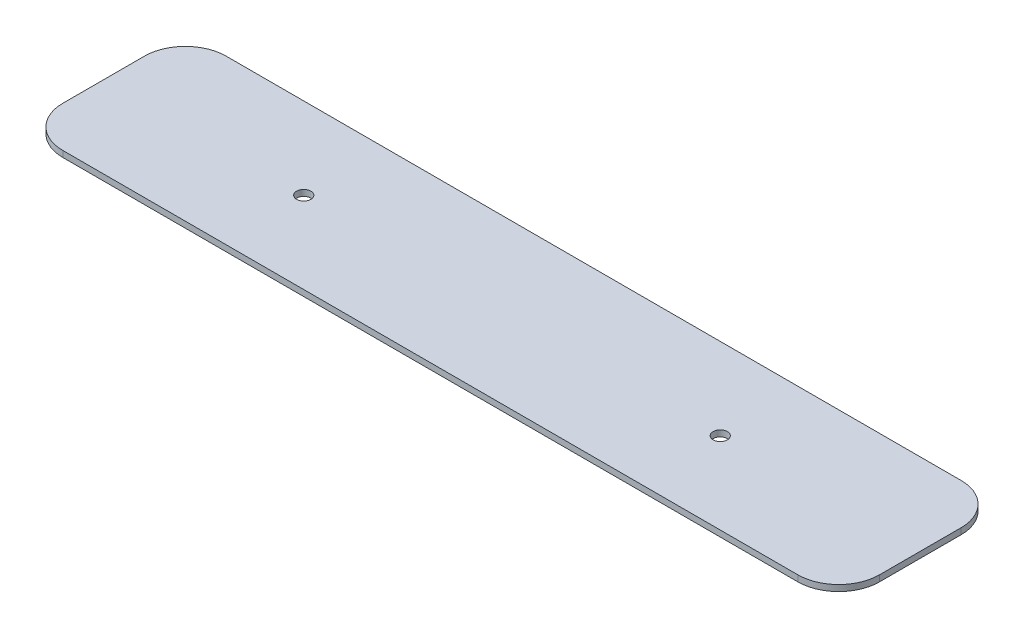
ISO-10303-21;
HEADER;
FILE_DESCRIPTION(('STEP AP214'),'2;1');
FILE_NAME('part.step','',(''),(''),'','','');
FILE_SCHEMA(('AUTOMOTIVE_DESIGN { 1 0 10303 214 1 1 1 1 }'));
ENDSEC;
DATA;
#1=APPLICATION_CONTEXT('core data for automotive mechanical design processes');
#2=APPLICATION_PROTOCOL_DEFINITION('international standard','automotive_design',2000,#1);
#3=PRODUCT_CONTEXT('',#1,'mechanical');
#4=PRODUCT('Part','Part','',(#3));
#5=PRODUCT_RELATED_PRODUCT_CATEGORY('part','',(#4));
#6=PRODUCT_DEFINITION_FORMATION('','',#4);
#7=PRODUCT_DEFINITION_CONTEXT('part definition',#1,'design');
#8=PRODUCT_DEFINITION('design','',#6,#7);
#9=PRODUCT_DEFINITION_SHAPE('','',#8);
#10=(LENGTH_UNIT() NAMED_UNIT(*) SI_UNIT(.MILLI.,.METRE.));
#11=(NAMED_UNIT(*) PLANE_ANGLE_UNIT() SI_UNIT($,.RADIAN.));
#12=(NAMED_UNIT(*) SI_UNIT($,.STERADIAN.) SOLID_ANGLE_UNIT());
#13=UNCERTAINTY_MEASURE_WITH_UNIT(LENGTH_MEASURE(1.E-05),#10,'distance_accuracy_value','');
#14=(GEOMETRIC_REPRESENTATION_CONTEXT(3) GLOBAL_UNCERTAINTY_ASSIGNED_CONTEXT((#13)) GLOBAL_UNIT_ASSIGNED_CONTEXT((#10,
#11,#12)) REPRESENTATION_CONTEXT('',''));
#15=CARTESIAN_POINT('',(0.,0.,0.));
#16=DIRECTION('',(0.,0.,1.));
#17=DIRECTION('',(1.,0.,0.));
#18=AXIS2_PLACEMENT_3D('',#15,#16,#17);
#19=CARTESIAN_POINT('',(10.,1.5,-30.));
#20=DIRECTION('',(0.,-1.,0.));
#21=DIRECTION('',(0.,0.,-1.));
#22=AXIS2_PLACEMENT_3D('',#19,#20,#21);
#23=PLANE('',#22);
#24=CARTESIAN_POINT('',(49.,1.5,-20.));
#25=DIRECTION('',(0.,1.,0.));
#26=DIRECTION('',(0.,0.,1.));
#27=AXIS2_PLACEMENT_3D('',#24,#25,#26);
#28=CIRCLE('',#27,1.75);
#29=CARTESIAN_POINT('',(49.,1.5,-18.25));
#30=VERTEX_POINT('',#29);
#31=EDGE_CURVE('E114',#30,#30,#28,.T.);
#32=ORIENTED_EDGE('',*,*,#31,.F.);
#33=EDGE_LOOP('',(#32));
#34=FACE_BOUND('',#33,.T.);
#35=CARTESIAN_POINT('',(10.,1.5,-30.));
#36=DIRECTION('',(0.,1.,0.));
#37=DIRECTION('',(0.,0.,-1.));
#38=AXIS2_PLACEMENT_3D('',#35,#36,#37);
#39=CIRCLE('',#38,10.);
#40=CARTESIAN_POINT('',(10.0000000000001,1.5,-40.));
#41=VERTEX_POINT('',#40);
#42=CARTESIAN_POINT('',(0.,1.5,-29.9999999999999));
#43=VERTEX_POINT('',#42);
#44=EDGE_CURVE('E132',#41,#43,#39,.T.);
#45=ORIENTED_EDGE('',*,*,#44,.T.);
#46=DIRECTION('',(0.,0.,1.));
#47=VECTOR('',#46,1.);
#48=CARTESIAN_POINT('',(0.,1.5,-10.0000000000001));
#49=LINE('',#48,#47);
#50=CARTESIAN_POINT('',(0.,1.5,-10.0000000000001));
#51=VERTEX_POINT('',#50);
#52=EDGE_CURVE('E109',#43,#51,#49,.T.);
#53=ORIENTED_EDGE('',*,*,#52,.T.);
#54=CARTESIAN_POINT('',(10.,1.5,-10.));
#55=DIRECTION('',(0.,1.,0.));
#56=DIRECTION('',(0.,0.,-1.));
#57=AXIS2_PLACEMENT_3D('',#54,#55,#56);
#58=CIRCLE('',#57,10.);
#59=CARTESIAN_POINT('',(10.0000000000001,1.5,0.));
#60=VERTEX_POINT('',#59);
#61=EDGE_CURVE('E135',#51,#60,#58,.T.);
#62=ORIENTED_EDGE('',*,*,#61,.T.);
#63=DIRECTION('',(1.,0.,0.));
#64=VECTOR('',#63,1.);
#65=CARTESIAN_POINT('',(10.0000000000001,1.5,0.));
#66=LINE('',#65,#64);
#67=CARTESIAN_POINT('',(190.,1.5,0.));
#68=VERTEX_POINT('',#67);
#69=EDGE_CURVE('E137',#60,#68,#66,.T.);
#70=ORIENTED_EDGE('',*,*,#69,.T.);
#71=CARTESIAN_POINT('',(190.,1.5,-10.));
#72=DIRECTION('',(0.,1.,0.));
#73=DIRECTION('',(0.,0.,-1.));
#74=AXIS2_PLACEMENT_3D('',#71,#72,#73);
#75=CIRCLE('',#74,10.);
#76=CARTESIAN_POINT('',(200.,1.5,-10.0000000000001));
#77=VERTEX_POINT('',#76);
#78=EDGE_CURVE('E139',#68,#77,#75,.T.);
#79=ORIENTED_EDGE('',*,*,#78,.T.);
#80=DIRECTION('',(0.,0.,-1.));
#81=VECTOR('',#80,1.);
#82=CARTESIAN_POINT('',(200.,1.5,-10.0000000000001));
#83=LINE('',#82,#81);
#84=CARTESIAN_POINT('',(200.,1.5,-29.9999999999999));
#85=VERTEX_POINT('',#84);
#86=EDGE_CURVE('E141',#77,#85,#83,.T.);
#87=ORIENTED_EDGE('',*,*,#86,.T.);
#88=CARTESIAN_POINT('',(190.,1.5,-30.));
#89=DIRECTION('',(0.,1.,0.));
#90=DIRECTION('',(0.,0.,-1.));
#91=AXIS2_PLACEMENT_3D('',#88,#89,#90);
#92=CIRCLE('',#91,10.);
#93=CARTESIAN_POINT('',(190.,1.5,-40.));
#94=VERTEX_POINT('',#93);
#95=EDGE_CURVE('E50',#85,#94,#92,.T.);
#96=ORIENTED_EDGE('',*,*,#95,.T.);
#97=DIRECTION('',(-1.,0.,0.));
#98=VECTOR('',#97,1.);
#99=CARTESIAN_POINT('',(10.0000000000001,1.5,-40.));
#100=LINE('',#99,#98);
#101=EDGE_CURVE('E45',#94,#41,#100,.T.);
#102=ORIENTED_EDGE('',*,*,#101,.T.);
#103=EDGE_LOOP('',(#45,#53,#62,#70,#79,#87,#96,#102));
#104=FACE_BOUND('',#103,.T.);
#105=CARTESIAN_POINT('',(151.,1.5,-20.));
#106=DIRECTION('',(0.,1.,0.));
#107=DIRECTION('',(0.,0.,1.));
#108=AXIS2_PLACEMENT_3D('',#105,#106,#107);
#109=CIRCLE('',#108,1.75000000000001);
#110=CARTESIAN_POINT('',(151.,1.5,-18.25));
#111=VERTEX_POINT('',#110);
#112=EDGE_CURVE('E212',#111,#111,#109,.T.);
#113=ORIENTED_EDGE('',*,*,#112,.F.);
#114=EDGE_LOOP('',(#113));
#115=FACE_BOUND('',#114,.T.);
#116=ADVANCED_FACE('F30',(#34,#104,#115),#23,.F.);
#117=CARTESIAN_POINT('',(10.,0.,-30.));
#118=DIRECTION('',(0.,-1.,0.));
#119=DIRECTION('',(0.,0.,-1.));
#120=AXIS2_PLACEMENT_3D('',#117,#118,#119);
#121=PLANE('',#120);
#122=CARTESIAN_POINT('',(49.,0.,-20.));
#123=DIRECTION('',(0.,1.,0.));
#124=DIRECTION('',(0.,0.,1.));
#125=AXIS2_PLACEMENT_3D('',#122,#123,#124);
#126=CIRCLE('',#125,1.75);
#127=CARTESIAN_POINT('',(49.,0.,-18.25));
#128=VERTEX_POINT('',#127);
#129=EDGE_CURVE('E117',#128,#128,#126,.T.);
#130=ORIENTED_EDGE('',*,*,#129,.T.);
#131=EDGE_LOOP('',(#130));
#132=FACE_BOUND('',#131,.T.);
#133=CARTESIAN_POINT('',(10.,0.,-30.));
#134=DIRECTION('',(0.,1.,0.));
#135=DIRECTION('',(0.,0.,-1.));
#136=AXIS2_PLACEMENT_3D('',#133,#134,#135);
#137=CIRCLE('',#136,10.);
#138=CARTESIAN_POINT('',(10.0000000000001,0.,-40.));
#139=VERTEX_POINT('',#138);
#140=CARTESIAN_POINT('',(0.,0.,-29.9999999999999));
#141=VERTEX_POINT('',#140);
#142=EDGE_CURVE('E100',#139,#141,#137,.T.);
#143=ORIENTED_EDGE('',*,*,#142,.F.);
#144=DIRECTION('',(-1.,0.,0.));
#145=VECTOR('',#144,1.);
#146=CARTESIAN_POINT('',(10.0000000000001,0.,-40.));
#147=LINE('',#146,#145);
#148=CARTESIAN_POINT('',(190.,0.,-40.));
#149=VERTEX_POINT('',#148);
#150=EDGE_CURVE('E130',#149,#139,#147,.T.);
#151=ORIENTED_EDGE('',*,*,#150,.F.);
#152=CARTESIAN_POINT('',(190.,0.,-30.));
#153=DIRECTION('',(0.,1.,0.));
#154=DIRECTION('',(0.,0.,-1.));
#155=AXIS2_PLACEMENT_3D('',#152,#153,#154);
#156=CIRCLE('',#155,10.);
#157=CARTESIAN_POINT('',(200.,0.,-29.9999999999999));
#158=VERTEX_POINT('',#157);
#159=EDGE_CURVE('E128',#158,#149,#156,.T.);
#160=ORIENTED_EDGE('',*,*,#159,.F.);
#161=DIRECTION('',(0.,0.,-1.));
#162=VECTOR('',#161,1.);
#163=CARTESIAN_POINT('',(200.,0.,-10.0000000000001));
#164=LINE('',#163,#162);
#165=CARTESIAN_POINT('',(200.,0.,-10.0000000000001));
#166=VERTEX_POINT('',#165);
#167=EDGE_CURVE('E126',#166,#158,#164,.T.);
#168=ORIENTED_EDGE('',*,*,#167,.F.);
#169=CARTESIAN_POINT('',(190.,0.,-10.));
#170=DIRECTION('',(0.,1.,0.));
#171=DIRECTION('',(0.,0.,-1.));
#172=AXIS2_PLACEMENT_3D('',#169,#170,#171);
#173=CIRCLE('',#172,10.);
#174=CARTESIAN_POINT('',(190.,0.,0.));
#175=VERTEX_POINT('',#174);
#176=EDGE_CURVE('E124',#175,#166,#173,.T.);
#177=ORIENTED_EDGE('',*,*,#176,.F.);
#178=DIRECTION('',(1.,0.,0.));
#179=VECTOR('',#178,1.);
#180=CARTESIAN_POINT('',(10.0000000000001,0.,0.));
#181=LINE('',#180,#179);
#182=CARTESIAN_POINT('',(10.0000000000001,0.,0.));
#183=VERTEX_POINT('',#182);
#184=EDGE_CURVE('E122',#183,#175,#181,.T.);
#185=ORIENTED_EDGE('',*,*,#184,.F.);
#186=CARTESIAN_POINT('',(10.,0.,-10.));
#187=DIRECTION('',(0.,1.,0.));
#188=DIRECTION('',(0.,0.,-1.));
#189=AXIS2_PLACEMENT_3D('',#186,#187,#188);
#190=CIRCLE('',#189,10.);
#191=CARTESIAN_POINT('',(0.,0.,-10.0000000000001));
#192=VERTEX_POINT('',#191);
#193=EDGE_CURVE('E102',#192,#183,#190,.T.);
#194=ORIENTED_EDGE('',*,*,#193,.F.);
#195=DIRECTION('',(0.,0.,1.));
#196=VECTOR('',#195,1.);
#197=CARTESIAN_POINT('',(0.,0.,-10.0000000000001));
#198=LINE('',#197,#196);
#199=EDGE_CURVE('E95',#141,#192,#198,.T.);
#200=ORIENTED_EDGE('',*,*,#199,.F.);
#201=EDGE_LOOP('',(#143,#151,#160,#168,#177,#185,#194,#200));
#202=FACE_BOUND('',#201,.T.);
#203=CARTESIAN_POINT('',(151.,0.,-20.));
#204=DIRECTION('',(0.,1.,0.));
#205=DIRECTION('',(0.,0.,1.));
#206=AXIS2_PLACEMENT_3D('',#203,#204,#205);
#207=CIRCLE('',#206,1.75000000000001);
#208=CARTESIAN_POINT('',(151.,0.,-18.25));
#209=VERTEX_POINT('',#208);
#210=EDGE_CURVE('E215',#209,#209,#207,.T.);
#211=ORIENTED_EDGE('',*,*,#210,.T.);
#212=EDGE_LOOP('',(#211));
#213=FACE_BOUND('',#212,.T.);
#214=ADVANCED_FACE('F96',(#132,#202,#213),#121,.T.);
#215=CARTESIAN_POINT('',(10.,1.5,-30.));
#216=DIRECTION('',(0.,-1.,0.));
#217=DIRECTION('',(0.,0.,-1.));
#218=AXIS2_PLACEMENT_3D('',#215,#216,#217);
#219=CYLINDRICAL_SURFACE('',#218,10.);
#220=ORIENTED_EDGE('',*,*,#142,.T.);
#221=DIRECTION('',(0.,-1.,0.));
#222=VECTOR('',#221,1.);
#223=CARTESIAN_POINT('',(0.,1.5,-29.9999999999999));
#224=LINE('',#223,#222);
#225=EDGE_CURVE('E11',#43,#141,#224,.T.);
#226=ORIENTED_EDGE('',*,*,#225,.F.);
#227=ORIENTED_EDGE('',*,*,#44,.F.);
#228=DIRECTION('',(0.,-1.,0.));
#229=VECTOR('',#228,1.);
#230=CARTESIAN_POINT('',(10.0000000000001,1.5,-40.));
#231=LINE('',#230,#229);
#232=EDGE_CURVE('E113',#41,#139,#231,.T.);
#233=ORIENTED_EDGE('',*,*,#232,.T.);
#234=EDGE_LOOP('',(#220,#226,#227,#233));
#235=FACE_BOUND('',#234,.T.);
#236=ADVANCED_FACE('F32',(#235),#219,.T.);
#237=CARTESIAN_POINT('',(0.,1.5,-10.0000000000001));
#238=DIRECTION('',(1.,0.,0.));
#239=DIRECTION('',(0.,0.,-1.));
#240=AXIS2_PLACEMENT_3D('',#237,#238,#239);
#241=PLANE('',#240);
#242=ORIENTED_EDGE('',*,*,#199,.T.);
#243=DIRECTION('',(0.,-1.,0.));
#244=VECTOR('',#243,1.);
#245=CARTESIAN_POINT('',(0.,1.5,-10.0000000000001));
#246=LINE('',#245,#244);
#247=EDGE_CURVE('E38',#51,#192,#246,.T.);
#248=ORIENTED_EDGE('',*,*,#247,.F.);
#249=ORIENTED_EDGE('',*,*,#52,.F.);
#250=ORIENTED_EDGE('',*,*,#225,.T.);
#251=EDGE_LOOP('',(#242,#248,#249,#250));
#252=FACE_BOUND('',#251,.T.);
#253=ADVANCED_FACE('F108',(#252),#241,.F.);
#254=CARTESIAN_POINT('',(10.,1.5,-10.));
#255=DIRECTION('',(0.,-1.,0.));
#256=DIRECTION('',(0.,0.,-1.));
#257=AXIS2_PLACEMENT_3D('',#254,#255,#256);
#258=CYLINDRICAL_SURFACE('',#257,10.);
#259=ORIENTED_EDGE('',*,*,#193,.T.);
#260=DIRECTION('',(0.,-1.,0.));
#261=VECTOR('',#260,1.);
#262=CARTESIAN_POINT('',(10.0000000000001,1.5,0.));
#263=LINE('',#262,#261);
#264=EDGE_CURVE('E158',#60,#183,#263,.T.);
#265=ORIENTED_EDGE('',*,*,#264,.F.);
#266=ORIENTED_EDGE('',*,*,#61,.F.);
#267=ORIENTED_EDGE('',*,*,#247,.T.);
#268=EDGE_LOOP('',(#259,#265,#266,#267));
#269=FACE_BOUND('',#268,.T.);
#270=ADVANCED_FACE('F162',(#269),#258,.T.);
#271=CARTESIAN_POINT('',(10.0000000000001,1.5,0.));
#272=DIRECTION('',(0.,0.,-1.));
#273=DIRECTION('',(-1.,0.,0.));
#274=AXIS2_PLACEMENT_3D('',#271,#272,#273);
#275=PLANE('',#274);
#276=ORIENTED_EDGE('',*,*,#184,.T.);
#277=DIRECTION('',(0.,-1.,0.));
#278=VECTOR('',#277,1.);
#279=CARTESIAN_POINT('',(190.,1.5,0.));
#280=LINE('',#279,#278);
#281=EDGE_CURVE('E155',#68,#175,#280,.T.);
#282=ORIENTED_EDGE('',*,*,#281,.F.);
#283=ORIENTED_EDGE('',*,*,#69,.F.);
#284=ORIENTED_EDGE('',*,*,#264,.T.);
#285=EDGE_LOOP('',(#276,#282,#283,#284));
#286=FACE_BOUND('',#285,.T.);
#287=ADVANCED_FACE('F170',(#286),#275,.F.);
#288=CARTESIAN_POINT('',(190.,1.5,-10.));
#289=DIRECTION('',(0.,-1.,0.));
#290=DIRECTION('',(0.,0.,-1.));
#291=AXIS2_PLACEMENT_3D('',#288,#289,#290);
#292=CYLINDRICAL_SURFACE('',#291,10.);
#293=ORIENTED_EDGE('',*,*,#176,.T.);
#294=DIRECTION('',(0.,-1.,0.));
#295=VECTOR('',#294,1.);
#296=CARTESIAN_POINT('',(200.,1.5,-10.0000000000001));
#297=LINE('',#296,#295);
#298=EDGE_CURVE('E152',#77,#166,#297,.T.);
#299=ORIENTED_EDGE('',*,*,#298,.F.);
#300=ORIENTED_EDGE('',*,*,#78,.F.);
#301=ORIENTED_EDGE('',*,*,#281,.T.);
#302=EDGE_LOOP('',(#293,#299,#300,#301));
#303=FACE_BOUND('',#302,.T.);
#304=ADVANCED_FACE('F173',(#303),#292,.T.);
#305=CARTESIAN_POINT('',(200.,1.5,-10.0000000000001));
#306=DIRECTION('',(-1.,0.,0.));
#307=DIRECTION('',(0.,0.,1.));
#308=AXIS2_PLACEMENT_3D('',#305,#306,#307);
#309=PLANE('',#308);
#310=ORIENTED_EDGE('',*,*,#167,.T.);
#311=DIRECTION('',(0.,-1.,0.));
#312=VECTOR('',#311,1.);
#313=CARTESIAN_POINT('',(200.,1.5,-29.9999999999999));
#314=LINE('',#313,#312);
#315=EDGE_CURVE('E149',#85,#158,#314,.T.);
#316=ORIENTED_EDGE('',*,*,#315,.F.);
#317=ORIENTED_EDGE('',*,*,#86,.F.);
#318=ORIENTED_EDGE('',*,*,#298,.T.);
#319=EDGE_LOOP('',(#310,#316,#317,#318));
#320=FACE_BOUND('',#319,.T.);
#321=ADVANCED_FACE('F178',(#320),#309,.F.);
#322=CARTESIAN_POINT('',(190.,1.5,-30.));
#323=DIRECTION('',(0.,-1.,0.));
#324=DIRECTION('',(0.,0.,-1.));
#325=AXIS2_PLACEMENT_3D('',#322,#323,#324);
#326=CYLINDRICAL_SURFACE('',#325,10.);
#327=ORIENTED_EDGE('',*,*,#159,.T.);
#328=DIRECTION('',(0.,-1.,0.));
#329=VECTOR('',#328,1.);
#330=CARTESIAN_POINT('',(190.,1.5,-40.));
#331=LINE('',#330,#329);
#332=EDGE_CURVE('E146',#94,#149,#331,.T.);
#333=ORIENTED_EDGE('',*,*,#332,.F.);
#334=ORIENTED_EDGE('',*,*,#95,.F.);
#335=ORIENTED_EDGE('',*,*,#315,.T.);
#336=EDGE_LOOP('',(#327,#333,#334,#335));
#337=FACE_BOUND('',#336,.T.);
#338=ADVANCED_FACE('F181',(#337),#326,.T.);
#339=CARTESIAN_POINT('',(10.0000000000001,1.5,-40.));
#340=DIRECTION('',(0.,0.,1.));
#341=DIRECTION('',(1.,0.,0.));
#342=AXIS2_PLACEMENT_3D('',#339,#340,#341);
#343=PLANE('',#342);
#344=ORIENTED_EDGE('',*,*,#150,.T.);
#345=ORIENTED_EDGE('',*,*,#232,.F.);
#346=ORIENTED_EDGE('',*,*,#101,.F.);
#347=ORIENTED_EDGE('',*,*,#332,.T.);
#348=EDGE_LOOP('',(#344,#345,#346,#347));
#349=FACE_BOUND('',#348,.T.);
#350=ADVANCED_FACE('F183',(#349),#343,.F.);
#351=CARTESIAN_POINT('',(49.,1.5,-20.));
#352=DIRECTION('',(0.,-1.,0.));
#353=DIRECTION('',(0.,0.,-1.));
#354=AXIS2_PLACEMENT_3D('',#351,#352,#353);
#355=CYLINDRICAL_SURFACE('',#354,1.75);
#356=ORIENTED_EDGE('',*,*,#31,.T.);
#357=EDGE_LOOP('',(#356));
#358=FACE_BOUND('',#357,.T.);
#359=ORIENTED_EDGE('',*,*,#129,.F.);
#360=EDGE_LOOP('',(#359));
#361=FACE_BOUND('',#360,.T.);
#362=ADVANCED_FACE('F185',(#358,#361),#355,.F.);
#363=CARTESIAN_POINT('',(151.,1.5,-20.));
#364=DIRECTION('',(0.,-1.,0.));
#365=DIRECTION('',(0.,0.,-1.));
#366=AXIS2_PLACEMENT_3D('',#363,#364,#365);
#367=CYLINDRICAL_SURFACE('',#366,1.75000000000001);
#368=ORIENTED_EDGE('',*,*,#112,.T.);
#369=EDGE_LOOP('',(#368));
#370=FACE_BOUND('',#369,.T.);
#371=ORIENTED_EDGE('',*,*,#210,.F.);
#372=EDGE_LOOP('',(#371));
#373=FACE_BOUND('',#372,.T.);
#374=ADVANCED_FACE('F191',(#370,#373),#367,.F.);
#375=CLOSED_SHELL('',(#116,#214,#236,#253,#270,#287,#304,#321,#338,#350,#362,#374));
#376=MANIFOLD_SOLID_BREP('B2',#375);
#377=ADVANCED_BREP_SHAPE_REPRESENTATION('',(#18,#376),#14);
#378=SHAPE_DEFINITION_REPRESENTATION(#9,#377);
ENDSEC;
END-ISO-10303-21;
